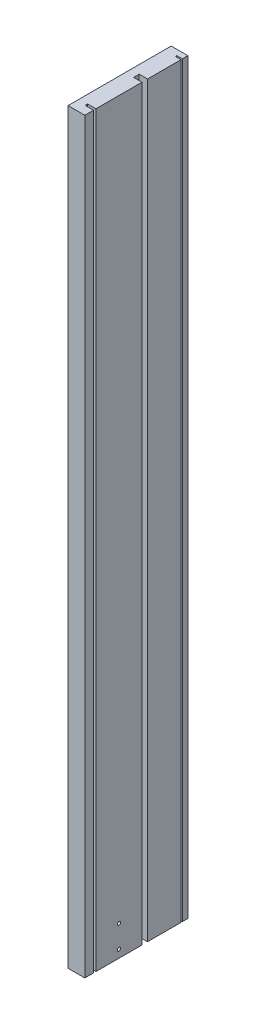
from build123d import *

# Parameters (mm, degrees)
SKETCH2_W           = 234.95
SKETCH2_H           = 1219.2
BOSS_EXTRUDE1_DEPTH = 19.05
SKETCH3_W           = 19.05
SKETCH3_H           = 5.588
SKETCH3_H_2         = 12.7
SKETCH3_W_2         = 12.7
SKETCH3_H_3         = 3.175
CUT_EXTRUDE1_DEPTH  = 1242.778178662
BOSS_EXTRUDE2_DEPTH = 482.6
SKETCH5_R           = 3.81
CUT_EXTRUDE2_DEPTH  = 1243.21646765


with BuildPart() as part:
    # Sketch2 → Boss-Extrude1 (new, symmetric)
    with BuildSketch(Plane(origin=(0, 0, 0), x_dir=(0, 0, -1), z_dir=(1, 0, 0))):
        with Locations((117.475, 609.6)):
            Rectangle(SKETCH2_W, SKETCH2_H)
    extrude(amount=BOSS_EXTRUDE1_DEPTH, both=True)

    # Sketch3 → Cut-Extrude1 (cut, through all)
    with BuildSketch(Plane(origin=(0, 1219.2, 0), x_dir=(1, 0, 0), z_dir=(0, 1, 0))):
        with Locations((9.525, 22.606)):
            Rectangle(SKETCH3_W, SKETCH3_H)
        with Locations((9.525, 136.525)):
            Rectangle(SKETCH3_W, SKETCH3_H_2)
        with Locations((12.7, 220.6625)):
            Rectangle(SKETCH3_W_2, SKETCH3_H_3)
    extrude(amount=-CUT_EXTRUDE1_DEPTH, mode=Mode.SUBTRACT)

    # Sketch4 → Boss-Extrude2 (add)
    with BuildSketch(Plane.XZ):
        Polygon((0, -25.4), (0, -19.812), (19.05, -19.812), (19.05, 0), (-19.05, 0), (-19.05, -234.95), (19.05, -234.95), (19.05, -222.25), (6.35, -222.25), (6.35, -219.075), (19.05, -219.075), (19.05, -142.875), (0, -142.875), (0, -130.175), (19.05, -130.175), (19.05, -25.4), align=None)
    extrude(amount=BOSS_EXTRUDE2_DEPTH)

    # Sketch5 → Cut-Extrude2 (cut, through all)
    with BuildSketch(Plane.ZY.offset(19.05)):
        with Locations((-77.7875, -414.02)):
            Circle(SKETCH5_R)
        with Locations((-77.7875, -464.82)):
            Circle(SKETCH5_R)
    extrude(amount=-CUT_EXTRUDE2_DEPTH, mode=Mode.SUBTRACT)


solid = part.part
